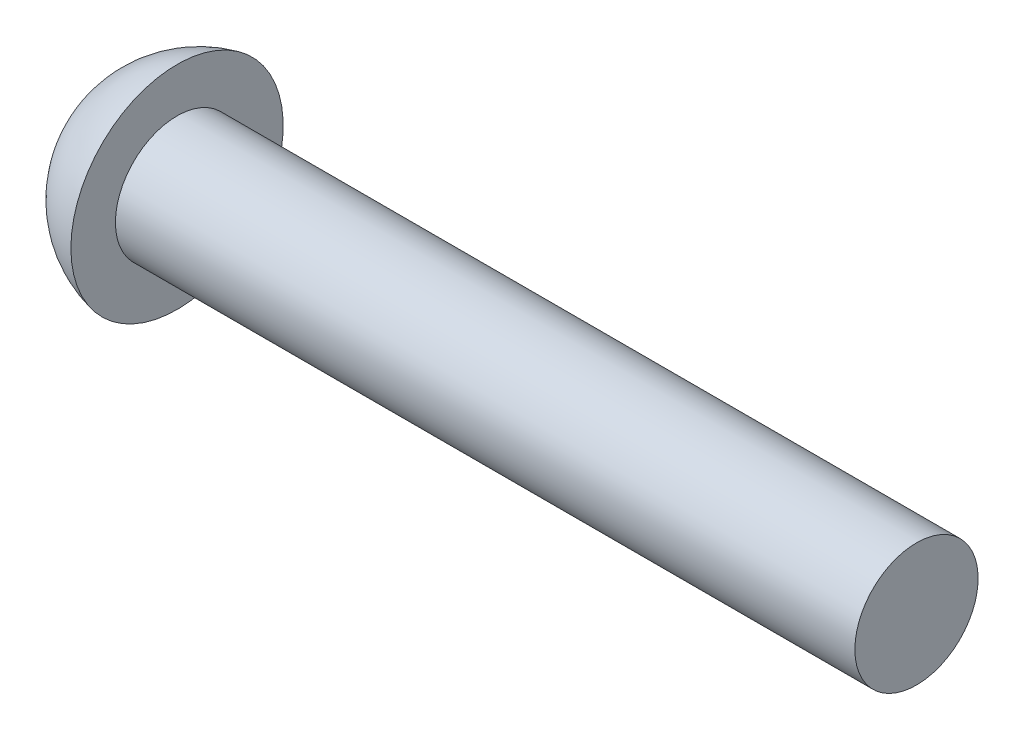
ISO-10303-21;
HEADER;
FILE_DESCRIPTION(('STEP AP214'),'2;1');
FILE_NAME('part.step','',(''),(''),'','','');
FILE_SCHEMA(('AUTOMOTIVE_DESIGN { 1 0 10303 214 1 1 1 1 }'));
ENDSEC;
DATA;
#1=APPLICATION_CONTEXT('core data for automotive mechanical design processes');
#2=APPLICATION_PROTOCOL_DEFINITION('international standard','automotive_design',2000,#1);
#3=PRODUCT_CONTEXT('',#1,'mechanical');
#4=PRODUCT('Part','Part','',(#3));
#5=PRODUCT_RELATED_PRODUCT_CATEGORY('part','',(#4));
#6=PRODUCT_DEFINITION_FORMATION('','',#4);
#7=PRODUCT_DEFINITION_CONTEXT('part definition',#1,'design');
#8=PRODUCT_DEFINITION('design','',#6,#7);
#9=PRODUCT_DEFINITION_SHAPE('','',#8);
#10=(LENGTH_UNIT() NAMED_UNIT(*) SI_UNIT(.MILLI.,.METRE.));
#11=(NAMED_UNIT(*) PLANE_ANGLE_UNIT() SI_UNIT($,.RADIAN.));
#12=(NAMED_UNIT(*) SI_UNIT($,.STERADIAN.) SOLID_ANGLE_UNIT());
#13=UNCERTAINTY_MEASURE_WITH_UNIT(LENGTH_MEASURE(1.E-05),#10,'distance_accuracy_value','');
#14=(GEOMETRIC_REPRESENTATION_CONTEXT(3) GLOBAL_UNCERTAINTY_ASSIGNED_CONTEXT((#13)) GLOBAL_UNIT_ASSIGNED_CONTEXT((#10,
#11,#12)) REPRESENTATION_CONTEXT('',''));
#15=CARTESIAN_POINT('',(0.,0.,0.));
#16=DIRECTION('',(0.,0.,1.));
#17=DIRECTION('',(1.,0.,0.));
#18=AXIS2_PLACEMENT_3D('',#15,#16,#17);
#19=CARTESIAN_POINT('',(4.4,0.,0.));
#20=DIRECTION('',(-1.,0.,0.));
#21=DIRECTION('',(0.,1.,0.));
#22=AXIS2_PLACEMENT_3D('',#19,#20,#21);
#23=SPHERICAL_SURFACE('',#22,4.4);
#24=CARTESIAN_POINT('',(3.5,0.,0.));
#25=DIRECTION('',(-1.,0.,0.));
#26=DIRECTION('',(0.,0.,1.));
#27=AXIS2_PLACEMENT_3D('',#24,#25,#26);
#28=CIRCLE('',#27,4.30697109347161);
#29=CARTESIAN_POINT('',(3.5,0.,4.30697109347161));
#30=VERTEX_POINT('',#29);
#31=EDGE_CURVE('E198',#30,#30,#28,.T.);
#32=ORIENTED_EDGE('',*,*,#31,.T.);
#33=EDGE_LOOP('',(#32));
#34=FACE_BOUND('',#33,.T.);
#35=CARTESIAN_POINT('',(0.12421590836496,0.,0.));
#36=DIRECTION('',(1.,0.,0.));
#37=DIRECTION('',(0.,0.,-1.));
#38=AXIS2_PLACEMENT_3D('',#35,#36,#37);
#39=CIRCLE('',#38,1.03810905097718);
#40=CARTESIAN_POINT('',(0.124215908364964,-0.349999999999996,-0.977328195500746));
#41=VERTEX_POINT('',#40);
#42=CARTESIAN_POINT('',(0.12421590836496,-0.977328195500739,-0.35));
#43=VERTEX_POINT('',#42);
#44=EDGE_CURVE('E320',#41,#43,#39,.F.);
#45=ORIENTED_EDGE('',*,*,#44,.F.);
#46=CARTESIAN_POINT('',(4.4,-0.35,0.));
#47=DIRECTION('',(0.,1.,0.));
#48=DIRECTION('',(0.,0.,1.));
#49=AXIS2_PLACEMENT_3D('',#46,#47,#48);
#50=CIRCLE('',#49,4.38605745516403);
#51=CARTESIAN_POINT('',(0.650493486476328,-0.349999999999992,-2.27567592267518));
#52=VERTEX_POINT('',#51);
#53=EDGE_CURVE('E247',#52,#41,#50,.T.);
#54=ORIENTED_EDGE('',*,*,#53,.F.);
#55=CARTESIAN_POINT('',(4.5622192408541,0.,-0.325361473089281));
#56=DIRECTION('',(0.446197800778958,0.,-0.894934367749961));
#57=DIRECTION('',(-0.89493436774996,0.,-0.446197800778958));
#58=AXIS2_PLACEMENT_3D('',#55,#56,#57);
#59=CIRCLE('',#58,4.38495437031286);
#60=CARTESIAN_POINT('',(0.650493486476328,0.350000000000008,-2.27567592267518));
#61=VERTEX_POINT('',#60);
#62=EDGE_CURVE('E221',#52,#61,#59,.T.);
#63=ORIENTED_EDGE('',*,*,#62,.T.);
#64=CARTESIAN_POINT('',(4.4,0.35,0.));
#65=DIRECTION('',(0.,-1.,0.));
#66=DIRECTION('',(0.,0.,-1.));
#67=AXIS2_PLACEMENT_3D('',#64,#65,#66);
#68=CIRCLE('',#67,4.38605745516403);
#69=CARTESIAN_POINT('',(0.124215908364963,0.350000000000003,-0.977328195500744));
#70=VERTEX_POINT('',#69);
#71=EDGE_CURVE('E276',#70,#61,#68,.T.);
#72=ORIENTED_EDGE('',*,*,#71,.F.);
#73=CARTESIAN_POINT('',(0.12421590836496,0.977328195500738,-0.35));
#74=VERTEX_POINT('',#73);
#75=EDGE_CURVE('E336',#74,#70,#39,.F.);
#76=ORIENTED_EDGE('',*,*,#75,.F.);
#77=CARTESIAN_POINT('',(4.4,0.,-0.35));
#78=DIRECTION('',(0.,0.,1.));
#79=DIRECTION('',(1.,0.,0.));
#80=AXIS2_PLACEMENT_3D('',#77,#78,#79);
#81=CIRCLE('',#80,4.38605745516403);
#82=CARTESIAN_POINT('',(0.650493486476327,2.27567592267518,-0.35));
#83=VERTEX_POINT('',#82);
#84=EDGE_CURVE('E215',#83,#74,#81,.T.);
#85=ORIENTED_EDGE('',*,*,#84,.F.);
#86=CARTESIAN_POINT('',(4.5622192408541,0.325361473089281,0.));
#87=DIRECTION('',(0.446197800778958,0.894934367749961,0.));
#88=DIRECTION('',(-0.89493436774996,0.446197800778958,0.));
#89=AXIS2_PLACEMENT_3D('',#86,#87,#88);
#90=CIRCLE('',#89,4.38495437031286);
#91=CARTESIAN_POINT('',(0.650493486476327,2.27567592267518,0.35));
#92=VERTEX_POINT('',#91);
#93=EDGE_CURVE('E218',#83,#92,#90,.T.);
#94=ORIENTED_EDGE('',*,*,#93,.T.);
#95=CARTESIAN_POINT('',(4.4,0.,0.35));
#96=DIRECTION('',(0.,0.,-1.));
#97=DIRECTION('',(0.,1.,0.));
#98=AXIS2_PLACEMENT_3D('',#95,#96,#97);
#99=CIRCLE('',#98,4.38605745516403);
#100=CARTESIAN_POINT('',(0.12421590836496,0.977328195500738,0.35));
#101=VERTEX_POINT('',#100);
#102=EDGE_CURVE('E206',#101,#92,#99,.T.);
#103=ORIENTED_EDGE('',*,*,#102,.F.);
#104=CARTESIAN_POINT('',(0.124215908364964,0.349999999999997,0.977328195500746));
#105=VERTEX_POINT('',#104);
#106=EDGE_CURVE('E335',#105,#101,#39,.F.);
#107=ORIENTED_EDGE('',*,*,#106,.F.);
#108=CARTESIAN_POINT('',(0.650493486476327,0.349999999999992,2.27567592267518));
#109=VERTEX_POINT('',#108);
#110=EDGE_CURVE('E231',#109,#105,#68,.T.);
#111=ORIENTED_EDGE('',*,*,#110,.F.);
#112=CARTESIAN_POINT('',(4.5622192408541,0.,0.325361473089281));
#113=DIRECTION('',(0.446197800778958,0.,0.894934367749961));
#114=DIRECTION('',(0.89493436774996,0.,-0.446197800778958));
#115=AXIS2_PLACEMENT_3D('',#112,#113,#114);
#116=CIRCLE('',#115,4.38495437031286);
#117=CARTESIAN_POINT('',(0.650493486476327,-0.350000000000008,2.27567592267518));
#118=VERTEX_POINT('',#117);
#119=EDGE_CURVE('E50',#109,#118,#116,.T.);
#120=ORIENTED_EDGE('',*,*,#119,.T.);
#121=CARTESIAN_POINT('',(0.124215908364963,-0.350000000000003,0.977328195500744));
#122=VERTEX_POINT('',#121);
#123=EDGE_CURVE('E228',#122,#118,#50,.T.);
#124=ORIENTED_EDGE('',*,*,#123,.F.);
#125=CARTESIAN_POINT('',(0.12421590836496,-0.977328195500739,0.35));
#126=VERTEX_POINT('',#125);
#127=EDGE_CURVE('E366',#126,#122,#39,.F.);
#128=ORIENTED_EDGE('',*,*,#127,.F.);
#129=CARTESIAN_POINT('',(0.650493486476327,-2.27567592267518,0.35));
#130=VERTEX_POINT('',#129);
#131=EDGE_CURVE('E212',#130,#126,#99,.T.);
#132=ORIENTED_EDGE('',*,*,#131,.F.);
#133=CARTESIAN_POINT('',(4.5622192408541,-0.325361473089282,0.));
#134=DIRECTION('',(0.446197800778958,-0.894934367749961,0.));
#135=DIRECTION('',(0.89493436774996,0.446197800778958,0.));
#136=AXIS2_PLACEMENT_3D('',#133,#134,#135);
#137=CIRCLE('',#136,4.38495437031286);
#138=CARTESIAN_POINT('',(0.650493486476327,-2.27567592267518,-0.35));
#139=VERTEX_POINT('',#138);
#140=EDGE_CURVE('E203',#130,#139,#137,.T.);
#141=ORIENTED_EDGE('',*,*,#140,.T.);
#142=EDGE_CURVE('E65',#43,#139,#81,.T.);
#143=ORIENTED_EDGE('',*,*,#142,.F.);
#144=EDGE_LOOP('',(#45,#54,#63,#72,#76,#85,#94,#103,#107,#111,#120,#124,#128,#132,#141,#143));
#145=FACE_BOUND('',#144,.T.);
#146=ADVANCED_FACE('F37',(#34,#145),#23,.T.);
#147=CARTESIAN_POINT('',(2.8,1.20397154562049,-0.35));
#148=DIRECTION('',(0.,0.,1.));
#149=DIRECTION('',(1.,0.,0.));
#150=AXIS2_PLACEMENT_3D('',#147,#148,#149);
#151=PLANE('',#150);
#152=ORIENTED_EDGE('',*,*,#84,.T.);
#153=CARTESIAN_POINT('',(-1.50567181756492,1.09763049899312,-0.35));
#154=CARTESIAN_POINT('',(-1.18894413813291,1.07438236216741,-0.35));
#155=CARTESIAN_POINT('',(-0.872221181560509,1.05106961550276,-0.35));
#156=CARTESIAN_POINT('',(-0.238786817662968,1.00427809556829,-0.35));
#157=CARTESIAN_POINT('',(0.0779245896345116,0.980799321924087,-0.35));
#158=CARTESIAN_POINT('',(0.711332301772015,0.933639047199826,-0.35));
#159=CARTESIAN_POINT('',(1.02802860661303,0.909957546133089,-0.35));
#160=CARTESIAN_POINT('',(1.66140140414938,0.862338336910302,-0.35));
#161=CARTESIAN_POINT('',(1.97807789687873,0.838400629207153,-0.35));
#162=CARTESIAN_POINT('',(2.74427771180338,0.780084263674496,-0.35));
#163=CARTESIAN_POINT('',(3.19378838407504,0.745539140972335,-0.35));
#164=CARTESIAN_POINT('',(4.09273207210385,0.675470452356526,-0.35));
#165=CARTESIAN_POINT('',(4.54216508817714,0.639946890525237,-0.35));
#166=CARTESIAN_POINT('',(5.21622299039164,0.585458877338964,-0.35));
#167=CARTESIAN_POINT('',(5.44089636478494,0.567095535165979,-0.35));
#168=CARTESIAN_POINT('',(5.89019733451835,0.529824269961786,-0.35));
#169=CARTESIAN_POINT('',(6.1148249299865,0.510916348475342,-0.35));
#170=CARTESIAN_POINT('',(6.56402183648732,0.472366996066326,-0.35));
#171=CARTESIAN_POINT('',(6.78859114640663,0.452725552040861,-0.35));
#172=CARTESIAN_POINT('',(7.23762949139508,0.412307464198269,-0.35));
#173=CARTESIAN_POINT('',(7.46209852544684,0.391530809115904,-0.35));
#174=CARTESIAN_POINT('',(7.68649620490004,0.369985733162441,-0.35));
#175=B_SPLINE_CURVE_WITH_KNOTS('',3,(#153,#154,#155,#156,#157,#158,#159,#160,#161,#162,#163,
#164,#165,#166,#167,#168,#169,#170,#171,#172,#173,#174),.UNSPECIFIED.,.F.,.F.,(4,2,2,2,2,2,2,2,
2,2,4),(0.,0.952739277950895,1.90548070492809,2.85822206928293,3.81096174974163,
5.16346955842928,6.51597172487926,7.19223892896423,7.86850421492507,8.54478158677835,
9.22106567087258),.UNSPECIFIED.);
#176=CARTESIAN_POINT('',(2.8,0.775693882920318,-0.349999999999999));
#177=VERTEX_POINT('',#176);
#178=EDGE_CURVE('E355',#74,#177,#175,.T.);
#179=ORIENTED_EDGE('',*,*,#178,.T.);
#180=DIRECTION('',(0.,1.,0.));
#181=VECTOR('',#180,1.);
#182=CARTESIAN_POINT('',(2.8,-1.20397154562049,-0.35));
#183=LINE('',#182,#181);
#184=CARTESIAN_POINT('',(2.8,1.20397154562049,-0.35));
#185=VERTEX_POINT('',#184);
#186=EDGE_CURVE('E299',#177,#185,#183,.T.);
#187=ORIENTED_EDGE('',*,*,#186,.T.);
#188=DIRECTION('',(0.89493436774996,-0.446197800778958,0.));
#189=VECTOR('',#188,1.);
#190=CARTESIAN_POINT('',(0.,2.6,-0.35));
#191=LINE('',#190,#189);
#192=EDGE_CURVE('E277',#83,#185,#191,.T.);
#193=ORIENTED_EDGE('',*,*,#192,.F.);
#194=EDGE_LOOP('',(#152,#179,#187,#193));
#195=FACE_BOUND('',#194,.T.);
#196=ADVANCED_FACE('F171',(#195),#151,.T.);
#197=CARTESIAN_POINT('',(2.8,-1.20397154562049,-0.35));
#198=VERTEX_POINT('',#197);
#199=CARTESIAN_POINT('',(2.8,-0.775693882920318,-0.349999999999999));
#200=VERTEX_POINT('',#199);
#201=EDGE_CURVE('E297',#198,#200,#183,.T.);
#202=ORIENTED_EDGE('',*,*,#201,.T.);
#203=CARTESIAN_POINT('',(-1.50567181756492,-1.09763049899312,-0.35));
#204=CARTESIAN_POINT('',(-1.18894413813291,-1.07438236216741,-0.35));
#205=CARTESIAN_POINT('',(-0.872221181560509,-1.05106961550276,-0.35));
#206=CARTESIAN_POINT('',(-0.238786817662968,-1.00427809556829,-0.35));
#207=CARTESIAN_POINT('',(0.0779245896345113,-0.980799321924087,-0.35));
#208=CARTESIAN_POINT('',(0.711332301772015,-0.933639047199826,-0.35));
#209=CARTESIAN_POINT('',(1.02802860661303,-0.909957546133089,-0.35));
#210=CARTESIAN_POINT('',(1.66140140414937,-0.862338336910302,-0.35));
#211=CARTESIAN_POINT('',(1.97807789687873,-0.838400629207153,-0.35));
#212=CARTESIAN_POINT('',(2.74427771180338,-0.780084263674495,-0.35));
#213=CARTESIAN_POINT('',(3.19378838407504,-0.745539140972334,-0.35));
#214=CARTESIAN_POINT('',(4.09273207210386,-0.675470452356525,-0.35));
#215=CARTESIAN_POINT('',(4.54216508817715,-0.639946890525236,-0.35));
#216=CARTESIAN_POINT('',(5.21622299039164,-0.585458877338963,-0.35));
#217=CARTESIAN_POINT('',(5.44089636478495,-0.567095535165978,-0.35));
#218=CARTESIAN_POINT('',(5.89019733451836,-0.529824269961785,-0.35));
#219=CARTESIAN_POINT('',(6.1148249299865,-0.510916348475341,-0.35));
#220=CARTESIAN_POINT('',(6.56402183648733,-0.472366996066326,-0.35));
#221=CARTESIAN_POINT('',(6.78859114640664,-0.452725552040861,-0.35));
#222=CARTESIAN_POINT('',(7.23762949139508,-0.412307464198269,-0.35));
#223=CARTESIAN_POINT('',(7.46209852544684,-0.391530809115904,-0.35));
#224=CARTESIAN_POINT('',(7.68649620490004,-0.36998573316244,-0.35));
#225=B_SPLINE_CURVE_WITH_KNOTS('',3,(#203,#204,#205,#206,#207,#208,#209,#210,#211,#212,#213,
#214,#215,#216,#217,#218,#219,#220,#221,#222,#223,#224),.UNSPECIFIED.,.F.,.F.,(4,2,2,2,2,2,2,2,
2,2,4),(0.,0.952739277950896,1.90548070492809,2.85822206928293,3.81096174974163,
5.16346955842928,6.51597172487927,7.19223892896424,7.86850421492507,8.54478158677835,
9.22106567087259),.UNSPECIFIED.);
#226=EDGE_CURVE('E334',#200,#43,#225,.F.);
#227=ORIENTED_EDGE('',*,*,#226,.T.);
#228=ORIENTED_EDGE('',*,*,#142,.T.);
#229=DIRECTION('',(0.89493436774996,0.446197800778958,0.));
#230=VECTOR('',#229,1.);
#231=CARTESIAN_POINT('',(0.,-2.6,-0.35));
#232=LINE('',#231,#230);
#233=EDGE_CURVE('E282',#139,#198,#232,.T.);
#234=ORIENTED_EDGE('',*,*,#233,.T.);
#235=EDGE_LOOP('',(#202,#227,#228,#234));
#236=FACE_BOUND('',#235,.T.);
#237=ADVANCED_FACE('F177',(#236),#151,.T.);
#238=CARTESIAN_POINT('',(2.8,-1.20397154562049,0.35));
#239=DIRECTION('',(0.,0.,-1.));
#240=DIRECTION('',(0.,1.,0.));
#241=AXIS2_PLACEMENT_3D('',#238,#239,#240);
#242=PLANE('',#241);
#243=DIRECTION('',(0.,-1.,0.));
#244=VECTOR('',#243,1.);
#245=CARTESIAN_POINT('',(2.8,1.20397154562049,0.35));
#246=LINE('',#245,#244);
#247=CARTESIAN_POINT('',(2.8,1.20397154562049,0.35));
#248=VERTEX_POINT('',#247);
#249=CARTESIAN_POINT('',(2.8,0.775693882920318,0.349999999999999));
#250=VERTEX_POINT('',#249);
#251=EDGE_CURVE('E290',#248,#250,#246,.T.);
#252=ORIENTED_EDGE('',*,*,#251,.T.);
#253=CARTESIAN_POINT('',(-1.50567181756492,1.09763049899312,0.35));
#254=CARTESIAN_POINT('',(-1.18894413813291,1.07438236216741,0.35));
#255=CARTESIAN_POINT('',(-0.872221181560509,1.05106961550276,0.35));
#256=CARTESIAN_POINT('',(-0.238786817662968,1.00427809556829,0.35));
#257=CARTESIAN_POINT('',(0.0779245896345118,0.980799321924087,0.35));
#258=CARTESIAN_POINT('',(0.711332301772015,0.933639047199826,0.35));
#259=CARTESIAN_POINT('',(1.02802860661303,0.909957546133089,0.35));
#260=CARTESIAN_POINT('',(1.66140140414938,0.862338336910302,0.35));
#261=CARTESIAN_POINT('',(1.97807789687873,0.838400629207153,0.35));
#262=CARTESIAN_POINT('',(2.74427771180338,0.780084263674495,0.35));
#263=CARTESIAN_POINT('',(3.19378838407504,0.745539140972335,0.35));
#264=CARTESIAN_POINT('',(4.09273207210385,0.675470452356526,0.35));
#265=CARTESIAN_POINT('',(4.54216508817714,0.639946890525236,0.35));
#266=CARTESIAN_POINT('',(5.21622299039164,0.585458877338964,0.35));
#267=CARTESIAN_POINT('',(5.44089636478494,0.567095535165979,0.35));
#268=CARTESIAN_POINT('',(5.89019733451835,0.529824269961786,0.35));
#269=CARTESIAN_POINT('',(6.1148249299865,0.510916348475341,0.35));
#270=CARTESIAN_POINT('',(6.56402183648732,0.472366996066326,0.35));
#271=CARTESIAN_POINT('',(6.78859114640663,0.452725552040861,0.35));
#272=CARTESIAN_POINT('',(7.23762949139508,0.412307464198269,0.35));
#273=CARTESIAN_POINT('',(7.46209852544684,0.391530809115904,0.35));
#274=CARTESIAN_POINT('',(7.68649620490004,0.36998573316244,0.35));
#275=B_SPLINE_CURVE_WITH_KNOTS('',3,(#253,#254,#255,#256,#257,#258,#259,#260,#261,#262,#263,
#264,#265,#266,#267,#268,#269,#270,#271,#272,#273,#274),.UNSPECIFIED.,.F.,.F.,(4,2,2,2,2,2,2,2,
2,2,4),(0.,0.952739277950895,1.90548070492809,2.85822206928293,3.81096174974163,
5.16346955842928,6.51597172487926,7.19223892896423,7.86850421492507,8.54478158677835,
9.22106567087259),.UNSPECIFIED.);
#276=EDGE_CURVE('E252',#250,#101,#275,.F.);
#277=ORIENTED_EDGE('',*,*,#276,.T.);
#278=ORIENTED_EDGE('',*,*,#102,.T.);
#279=DIRECTION('',(0.89493436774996,-0.446197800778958,0.));
#280=VECTOR('',#279,1.);
#281=CARTESIAN_POINT('',(0.,2.6,0.35));
#282=LINE('',#281,#280);
#283=EDGE_CURVE('E280',#92,#248,#282,.T.);
#284=ORIENTED_EDGE('',*,*,#283,.T.);
#285=EDGE_LOOP('',(#252,#277,#278,#284));
#286=FACE_BOUND('',#285,.T.);
#287=ADVANCED_FACE('F351',(#286),#242,.T.);
#288=ORIENTED_EDGE('',*,*,#131,.T.);
#289=CARTESIAN_POINT('',(-1.50567181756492,-1.09763049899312,0.35));
#290=CARTESIAN_POINT('',(-1.18894413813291,-1.07438236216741,0.35));
#291=CARTESIAN_POINT('',(-0.872221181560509,-1.05106961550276,0.35));
#292=CARTESIAN_POINT('',(-0.238786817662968,-1.00427809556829,0.35));
#293=CARTESIAN_POINT('',(0.0779245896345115,-0.980799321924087,0.35));
#294=CARTESIAN_POINT('',(0.711332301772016,-0.933639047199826,0.35));
#295=CARTESIAN_POINT('',(1.02802860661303,-0.909957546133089,0.35));
#296=CARTESIAN_POINT('',(1.66140140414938,-0.862338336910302,0.35));
#297=CARTESIAN_POINT('',(1.97807789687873,-0.838400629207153,0.35));
#298=CARTESIAN_POINT('',(2.74427771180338,-0.780084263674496,0.35));
#299=CARTESIAN_POINT('',(3.19378838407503,-0.745539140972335,0.35));
#300=CARTESIAN_POINT('',(4.09273207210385,-0.675470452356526,0.35));
#301=CARTESIAN_POINT('',(4.54216508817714,-0.639946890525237,0.35));
#302=CARTESIAN_POINT('',(5.21622299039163,-0.585458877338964,0.35));
#303=CARTESIAN_POINT('',(5.44089636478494,-0.567095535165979,0.35));
#304=CARTESIAN_POINT('',(5.89019733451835,-0.529824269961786,0.35));
#305=CARTESIAN_POINT('',(6.11482492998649,-0.510916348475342,0.35));
#306=CARTESIAN_POINT('',(6.56402183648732,-0.472366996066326,0.35));
#307=CARTESIAN_POINT('',(6.78859114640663,-0.452725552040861,0.35));
#308=CARTESIAN_POINT('',(7.23762949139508,-0.412307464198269,0.35));
#309=CARTESIAN_POINT('',(7.46209852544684,-0.391530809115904,0.35));
#310=CARTESIAN_POINT('',(7.68649620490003,-0.36998573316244,0.35));
#311=B_SPLINE_CURVE_WITH_KNOTS('',3,(#289,#290,#291,#292,#293,#294,#295,#296,#297,#298,#299,
#300,#301,#302,#303,#304,#305,#306,#307,#308,#309,#310),.UNSPECIFIED.,.F.,.F.,(4,2,2,2,2,2,2,2,
2,2,4),(0.,0.952739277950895,1.90548070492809,2.85822206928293,3.81096174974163,
5.16346955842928,6.51597172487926,7.19223892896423,7.86850421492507,8.54478158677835,
9.22106567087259),.UNSPECIFIED.);
#312=CARTESIAN_POINT('',(2.8,-0.775693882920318,0.349999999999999));
#313=VERTEX_POINT('',#312);
#314=EDGE_CURVE('E367',#126,#313,#311,.T.);
#315=ORIENTED_EDGE('',*,*,#314,.T.);
#316=CARTESIAN_POINT('',(2.8,-1.20397154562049,0.35));
#317=VERTEX_POINT('',#316);
#318=EDGE_CURVE('E293',#313,#317,#246,.T.);
#319=ORIENTED_EDGE('',*,*,#318,.T.);
#320=DIRECTION('',(0.89493436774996,0.446197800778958,0.));
#321=VECTOR('',#320,1.);
#322=CARTESIAN_POINT('',(0.,-2.6,0.349999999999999));
#323=LINE('',#322,#321);
#324=EDGE_CURVE('E284',#130,#317,#323,.T.);
#325=ORIENTED_EDGE('',*,*,#324,.F.);
#326=EDGE_LOOP('',(#288,#315,#319,#325));
#327=FACE_BOUND('',#326,.T.);
#328=ADVANCED_FACE('F395',(#327),#242,.T.);
#329=CARTESIAN_POINT('',(2.8,1.20397154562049,-0.35));
#330=DIRECTION('',(-1.,0.,0.));
#331=DIRECTION('',(0.,0.,1.));
#332=AXIS2_PLACEMENT_3D('',#329,#330,#331);
#333=PLANE('',#332);
#334=ORIENTED_EDGE('',*,*,#318,.F.);
#335=CARTESIAN_POINT('',(2.8,0.,0.));
#336=DIRECTION('',(-1.,0.,0.));
#337=DIRECTION('',(0.,0.,1.));
#338=AXIS2_PLACEMENT_3D('',#335,#336,#337);
#339=CIRCLE('',#338,0.851);
#340=EDGE_CURVE('E329',#200,#313,#339,.T.);
#341=ORIENTED_EDGE('',*,*,#340,.F.);
#342=ORIENTED_EDGE('',*,*,#201,.F.);
#343=DIRECTION('',(0.,0.,1.));
#344=VECTOR('',#343,1.);
#345=CARTESIAN_POINT('',(2.8,-1.20397154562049,-0.35));
#346=LINE('',#345,#344);
#347=EDGE_CURVE('E287',#198,#317,#346,.T.);
#348=ORIENTED_EDGE('',*,*,#347,.T.);
#349=EDGE_LOOP('',(#334,#341,#342,#348));
#350=FACE_BOUND('',#349,.T.);
#351=ADVANCED_FACE('F393',(#350),#333,.T.);
#352=DIRECTION('',(0.,0.,-1.));
#353=VECTOR('',#352,1.);
#354=CARTESIAN_POINT('',(2.8,-0.350000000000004,1.20397154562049));
#355=LINE('',#354,#353);
#356=CARTESIAN_POINT('',(2.8,-0.349999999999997,-0.775693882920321));
#357=VERTEX_POINT('',#356);
#358=CARTESIAN_POINT('',(2.8,-0.349999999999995,-1.20397154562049));
#359=VERTEX_POINT('',#358);
#360=EDGE_CURVE('E269',#357,#359,#355,.T.);
#361=ORIENTED_EDGE('',*,*,#360,.F.);
#362=CARTESIAN_POINT('',(2.8,0.350000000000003,-0.775693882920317));
#363=VERTEX_POINT('',#362);
#364=EDGE_CURVE('E57',#363,#357,#339,.T.);
#365=ORIENTED_EDGE('',*,*,#364,.F.);
#366=DIRECTION('',(0.,0.,1.));
#367=VECTOR('',#366,1.);
#368=CARTESIAN_POINT('',(2.8,0.350000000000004,-1.20397154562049));
#369=LINE('',#368,#367);
#370=CARTESIAN_POINT('',(2.8,0.350000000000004,-1.20397154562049));
#371=VERTEX_POINT('',#370);
#372=EDGE_CURVE('E272',#371,#363,#369,.T.);
#373=ORIENTED_EDGE('',*,*,#372,.F.);
#374=DIRECTION('',(0.,-1.,0.));
#375=VECTOR('',#374,1.);
#376=CARTESIAN_POINT('',(2.8,0.350000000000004,-1.20397154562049));
#377=LINE('',#376,#375);
#378=EDGE_CURVE('E263',#371,#359,#377,.T.);
#379=ORIENTED_EDGE('',*,*,#378,.T.);
#380=EDGE_LOOP('',(#361,#365,#373,#379));
#381=FACE_BOUND('',#380,.T.);
#382=ADVANCED_FACE('F324',(#381),#333,.T.);
#383=ORIENTED_EDGE('',*,*,#186,.F.);
#384=EDGE_CURVE('E328',#250,#177,#339,.T.);
#385=ORIENTED_EDGE('',*,*,#384,.F.);
#386=ORIENTED_EDGE('',*,*,#251,.F.);
#387=DIRECTION('',(0.,0.,-1.));
#388=VECTOR('',#387,1.);
#389=CARTESIAN_POINT('',(2.8,1.20397154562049,0.35));
#390=LINE('',#389,#388);
#391=EDGE_CURVE('E294',#248,#185,#390,.T.);
#392=ORIENTED_EDGE('',*,*,#391,.T.);
#393=EDGE_LOOP('',(#383,#385,#386,#392));
#394=FACE_BOUND('',#393,.T.);
#395=ADVANCED_FACE('F402',(#394),#333,.T.);
#396=CARTESIAN_POINT('',(2.8,0.349999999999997,0.775693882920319));
#397=VERTEX_POINT('',#396);
#398=CARTESIAN_POINT('',(2.8,0.349999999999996,1.20397154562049));
#399=VERTEX_POINT('',#398);
#400=EDGE_CURVE('E245',#397,#399,#369,.T.);
#401=ORIENTED_EDGE('',*,*,#400,.F.);
#402=CARTESIAN_POINT('',(2.8,-0.350000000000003,0.775693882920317));
#403=VERTEX_POINT('',#402);
#404=EDGE_CURVE('E332',#403,#397,#339,.T.);
#405=ORIENTED_EDGE('',*,*,#404,.F.);
#406=CARTESIAN_POINT('',(2.8,-0.350000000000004,1.20397154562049));
#407=VERTEX_POINT('',#406);
#408=EDGE_CURVE('E266',#407,#403,#355,.T.);
#409=ORIENTED_EDGE('',*,*,#408,.F.);
#410=DIRECTION('',(0.,1.,0.));
#411=VECTOR('',#410,1.);
#412=CARTESIAN_POINT('',(2.8,-0.350000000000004,1.20397154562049));
#413=LINE('',#412,#411);
#414=EDGE_CURVE('E270',#407,#399,#413,.T.);
#415=ORIENTED_EDGE('',*,*,#414,.T.);
#416=EDGE_LOOP('',(#401,#405,#409,#415));
#417=FACE_BOUND('',#416,.T.);
#418=ADVANCED_FACE('F397',(#417),#333,.T.);
#419=CARTESIAN_POINT('',(2.8,0.349999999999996,1.20397154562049));
#420=DIRECTION('',(0.,-1.,0.));
#421=DIRECTION('',(1.,0.,0.));
#422=AXIS2_PLACEMENT_3D('',#419,#420,#421);
#423=PLANE('',#422);
#424=ORIENTED_EDGE('',*,*,#110,.T.);
#425=CARTESIAN_POINT('',(-1.50567181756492,0.349999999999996,1.09763049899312));
#426=CARTESIAN_POINT('',(-1.18894413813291,0.349999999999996,1.07438236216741));
#427=CARTESIAN_POINT('',(-0.872221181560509,0.349999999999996,1.05106961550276));
#428=CARTESIAN_POINT('',(-0.238786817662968,0.349999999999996,1.00427809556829));
#429=CARTESIAN_POINT('',(0.0779245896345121,0.349999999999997,0.980799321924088));
#430=CARTESIAN_POINT('',(0.711332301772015,0.349999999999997,0.933639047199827));
#431=CARTESIAN_POINT('',(1.02802860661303,0.349999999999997,0.90995754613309));
#432=CARTESIAN_POINT('',(1.66140140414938,0.349999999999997,0.862338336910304));
#433=CARTESIAN_POINT('',(1.97807789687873,0.349999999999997,0.838400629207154));
#434=CARTESIAN_POINT('',(2.74427771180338,0.349999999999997,0.780084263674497));
#435=CARTESIAN_POINT('',(3.19378838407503,0.349999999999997,0.745539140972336));
#436=CARTESIAN_POINT('',(4.09273207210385,0.349999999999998,0.675470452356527));
#437=CARTESIAN_POINT('',(4.54216508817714,0.349999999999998,0.639946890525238));
#438=CARTESIAN_POINT('',(5.21622299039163,0.349999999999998,0.585458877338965));
#439=CARTESIAN_POINT('',(5.44089636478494,0.349999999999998,0.567095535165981));
#440=CARTESIAN_POINT('',(5.89019733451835,0.349999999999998,0.529824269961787));
#441=CARTESIAN_POINT('',(6.11482492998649,0.349999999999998,0.510916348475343));
#442=CARTESIAN_POINT('',(6.56402183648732,0.349999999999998,0.472366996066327));
#443=CARTESIAN_POINT('',(6.78859114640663,0.349999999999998,0.452725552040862));
#444=CARTESIAN_POINT('',(7.23762949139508,0.349999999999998,0.412307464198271));
#445=CARTESIAN_POINT('',(7.46209852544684,0.349999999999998,0.391530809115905));
#446=CARTESIAN_POINT('',(7.68649620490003,0.349999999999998,0.369985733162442));
#447=B_SPLINE_CURVE_WITH_KNOTS('',3,(#425,#426,#427,#428,#429,#430,#431,#432,#433,#434,#435,
#436,#437,#438,#439,#440,#441,#442,#443,#444,#445,#446),.UNSPECIFIED.,.F.,.F.,(4,2,2,2,2,2,2,2,
2,2,4),(0.,0.952739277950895,1.90548070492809,2.85822206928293,3.81096174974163,
5.16346955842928,6.51597172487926,7.19223892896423,7.86850421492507,8.54478158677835,
9.22106567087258),.UNSPECIFIED.);
#448=EDGE_CURVE('E417',#105,#397,#447,.T.);
#449=ORIENTED_EDGE('',*,*,#448,.T.);
#450=ORIENTED_EDGE('',*,*,#400,.T.);
#451=DIRECTION('',(0.89493436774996,0.,-0.446197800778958));
#452=VECTOR('',#451,1.);
#453=CARTESIAN_POINT('',(0.,0.349999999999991,2.6));
#454=LINE('',#453,#452);
#455=EDGE_CURVE('E238',#109,#399,#454,.T.);
#456=ORIENTED_EDGE('',*,*,#455,.F.);
#457=EDGE_LOOP('',(#424,#449,#450,#456));
#458=FACE_BOUND('',#457,.T.);
#459=ADVANCED_FACE('F242',(#458),#423,.T.);
#460=CARTESIAN_POINT('',(2.8,-0.349999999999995,-1.20397154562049));
#461=DIRECTION('',(0.,1.,0.));
#462=DIRECTION('',(0.,0.,1.));
#463=AXIS2_PLACEMENT_3D('',#460,#461,#462);
#464=PLANE('',#463);
#465=ORIENTED_EDGE('',*,*,#408,.T.);
#466=CARTESIAN_POINT('',(-1.50567181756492,-0.350000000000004,1.09763049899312));
#467=CARTESIAN_POINT('',(-1.18894413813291,-0.350000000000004,1.07438236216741));
#468=CARTESIAN_POINT('',(-0.872221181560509,-0.350000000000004,1.05106961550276));
#469=CARTESIAN_POINT('',(-0.238786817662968,-0.350000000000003,1.00427809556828));
#470=CARTESIAN_POINT('',(0.0779245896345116,-0.350000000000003,0.980799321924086));
#471=CARTESIAN_POINT('',(0.711332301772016,-0.350000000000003,0.933639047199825));
#472=CARTESIAN_POINT('',(1.02802860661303,-0.350000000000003,0.909957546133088));
#473=CARTESIAN_POINT('',(1.66140140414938,-0.350000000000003,0.862338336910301));
#474=CARTESIAN_POINT('',(1.97807789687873,-0.350000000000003,0.838400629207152));
#475=CARTESIAN_POINT('',(2.74427771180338,-0.350000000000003,0.780084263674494));
#476=CARTESIAN_POINT('',(3.19378838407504,-0.350000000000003,0.745539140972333));
#477=CARTESIAN_POINT('',(4.09273207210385,-0.350000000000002,0.675470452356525));
#478=CARTESIAN_POINT('',(4.54216508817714,-0.350000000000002,0.639946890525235));
#479=CARTESIAN_POINT('',(5.21622299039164,-0.350000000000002,0.585458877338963));
#480=CARTESIAN_POINT('',(5.44089636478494,-0.350000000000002,0.567095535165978));
#481=CARTESIAN_POINT('',(5.89019733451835,-0.350000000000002,0.529824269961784));
#482=CARTESIAN_POINT('',(6.1148249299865,-0.350000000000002,0.51091634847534));
#483=CARTESIAN_POINT('',(6.56402183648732,-0.350000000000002,0.472366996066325));
#484=CARTESIAN_POINT('',(6.78859114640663,-0.350000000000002,0.45272555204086));
#485=CARTESIAN_POINT('',(7.23762949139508,-0.350000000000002,0.412307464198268));
#486=CARTESIAN_POINT('',(7.46209852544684,-0.350000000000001,0.391530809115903));
#487=CARTESIAN_POINT('',(7.68649620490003,-0.350000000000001,0.369985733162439));
#488=B_SPLINE_CURVE_WITH_KNOTS('',3,(#466,#467,#468,#469,#470,#471,#472,#473,#474,#475,#476,
#477,#478,#479,#480,#481,#482,#483,#484,#485,#486,#487),.UNSPECIFIED.,.F.,.F.,(4,2,2,2,2,2,2,2,
2,2,4),(0.,0.952739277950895,1.90548070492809,2.85822206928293,3.81096174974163,
5.16346955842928,6.51597172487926,7.19223892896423,7.86850421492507,8.54478158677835,
9.22106567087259),.UNSPECIFIED.);
#489=EDGE_CURVE('E360',#403,#122,#488,.F.);
#490=ORIENTED_EDGE('',*,*,#489,.T.);
#491=ORIENTED_EDGE('',*,*,#123,.T.);
#492=DIRECTION('',(0.89493436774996,0.,-0.446197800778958));
#493=VECTOR('',#492,1.);
#494=CARTESIAN_POINT('',(0.,-0.350000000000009,2.6));
#495=LINE('',#494,#493);
#496=EDGE_CURVE('E240',#118,#407,#495,.T.);
#497=ORIENTED_EDGE('',*,*,#496,.T.);
#498=EDGE_LOOP('',(#465,#490,#491,#497));
#499=FACE_BOUND('',#498,.T.);
#500=ADVANCED_FACE('F371',(#499),#464,.T.);
#501=ORIENTED_EDGE('',*,*,#372,.T.);
#502=CARTESIAN_POINT('',(-1.50567181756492,0.350000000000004,-1.09763049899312));
#503=CARTESIAN_POINT('',(-1.18894413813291,0.350000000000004,-1.07438236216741));
#504=CARTESIAN_POINT('',(-0.872221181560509,0.350000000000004,-1.05106961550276));
#505=CARTESIAN_POINT('',(-0.238786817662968,0.350000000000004,-1.00427809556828));
#506=CARTESIAN_POINT('',(0.0779245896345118,0.350000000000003,-0.980799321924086));
#507=CARTESIAN_POINT('',(0.711332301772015,0.350000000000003,-0.933639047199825));
#508=CARTESIAN_POINT('',(1.02802860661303,0.350000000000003,-0.909957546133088));
#509=CARTESIAN_POINT('',(1.66140140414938,0.350000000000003,-0.862338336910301));
#510=CARTESIAN_POINT('',(1.97807789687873,0.350000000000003,-0.838400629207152));
#511=CARTESIAN_POINT('',(2.74427771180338,0.350000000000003,-0.780084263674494));
#512=CARTESIAN_POINT('',(3.19378838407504,0.350000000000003,-0.745539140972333));
#513=CARTESIAN_POINT('',(4.09273207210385,0.350000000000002,-0.675470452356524));
#514=CARTESIAN_POINT('',(4.54216508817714,0.350000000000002,-0.639946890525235));
#515=CARTESIAN_POINT('',(5.21622299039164,0.350000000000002,-0.585458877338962));
#516=CARTESIAN_POINT('',(5.44089636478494,0.350000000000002,-0.567095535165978));
#517=CARTESIAN_POINT('',(5.89019733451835,0.350000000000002,-0.529824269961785));
#518=CARTESIAN_POINT('',(6.1148249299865,0.350000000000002,-0.51091634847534));
#519=CARTESIAN_POINT('',(6.56402183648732,0.350000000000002,-0.472366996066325));
#520=CARTESIAN_POINT('',(6.78859114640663,0.350000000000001,-0.45272555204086));
#521=CARTESIAN_POINT('',(7.23762949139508,0.350000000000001,-0.412307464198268));
#522=CARTESIAN_POINT('',(7.46209852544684,0.350000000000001,-0.391530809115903));
#523=CARTESIAN_POINT('',(7.68649620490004,0.350000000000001,-0.369985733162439));
#524=B_SPLINE_CURVE_WITH_KNOTS('',3,(#502,#503,#504,#505,#506,#507,#508,#509,#510,#511,#512,
#513,#514,#515,#516,#517,#518,#519,#520,#521,#522,#523),.UNSPECIFIED.,.F.,.F.,(4,2,2,2,2,2,2,2,
2,2,4),(0.,0.952739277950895,1.90548070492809,2.85822206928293,3.81096174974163,
5.16346955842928,6.51597172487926,7.19223892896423,7.86850421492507,8.54478158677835,
9.22106567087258),.UNSPECIFIED.);
#525=EDGE_CURVE('E312',#363,#70,#524,.F.);
#526=ORIENTED_EDGE('',*,*,#525,.T.);
#527=ORIENTED_EDGE('',*,*,#71,.T.);
#528=DIRECTION('',(0.89493436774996,0.,0.446197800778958));
#529=VECTOR('',#528,1.);
#530=CARTESIAN_POINT('',(0.,0.350000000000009,-2.6));
#531=LINE('',#530,#529);
#532=EDGE_CURVE('E249',#61,#371,#531,.T.);
#533=ORIENTED_EDGE('',*,*,#532,.T.);
#534=EDGE_LOOP('',(#501,#526,#527,#533));
#535=FACE_BOUND('',#534,.T.);
#536=ADVANCED_FACE('F310',(#535),#423,.T.);
#537=ORIENTED_EDGE('',*,*,#53,.T.);
#538=CARTESIAN_POINT('',(-1.50567181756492,-0.349999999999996,-1.09763049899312));
#539=CARTESIAN_POINT('',(-1.18894413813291,-0.349999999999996,-1.07438236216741));
#540=CARTESIAN_POINT('',(-0.87222118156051,-0.349999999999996,-1.05106961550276));
#541=CARTESIAN_POINT('',(-0.238786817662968,-0.349999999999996,-1.00427809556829));
#542=CARTESIAN_POINT('',(0.0779245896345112,-0.349999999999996,-0.980799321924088));
#543=CARTESIAN_POINT('',(0.711332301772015,-0.349999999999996,-0.933639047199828));
#544=CARTESIAN_POINT('',(1.02802860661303,-0.349999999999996,-0.90995754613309));
#545=CARTESIAN_POINT('',(1.66140140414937,-0.349999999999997,-0.862338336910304));
#546=CARTESIAN_POINT('',(1.97807789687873,-0.349999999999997,-0.838400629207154));
#547=CARTESIAN_POINT('',(2.74427771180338,-0.349999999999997,-0.780084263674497));
#548=CARTESIAN_POINT('',(3.19378838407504,-0.349999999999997,-0.745539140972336));
#549=CARTESIAN_POINT('',(4.09273207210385,-0.349999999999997,-0.675470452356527));
#550=CARTESIAN_POINT('',(4.54216508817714,-0.349999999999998,-0.639946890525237));
#551=CARTESIAN_POINT('',(5.21622299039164,-0.349999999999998,-0.585458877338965));
#552=CARTESIAN_POINT('',(5.44089636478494,-0.349999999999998,-0.56709553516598));
#553=CARTESIAN_POINT('',(5.89019733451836,-0.349999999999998,-0.529824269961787));
#554=CARTESIAN_POINT('',(6.1148249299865,-0.349999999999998,-0.510916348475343));
#555=CARTESIAN_POINT('',(6.56402183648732,-0.349999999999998,-0.472366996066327));
#556=CARTESIAN_POINT('',(6.78859114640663,-0.349999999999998,-0.452725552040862));
#557=CARTESIAN_POINT('',(7.23762949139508,-0.349999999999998,-0.41230746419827));
#558=CARTESIAN_POINT('',(7.46209852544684,-0.349999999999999,-0.391530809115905));
#559=CARTESIAN_POINT('',(7.68649620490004,-0.349999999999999,-0.369985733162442));
#560=B_SPLINE_CURVE_WITH_KNOTS('',3,(#538,#539,#540,#541,#542,#543,#544,#545,#546,#547,#548,
#549,#550,#551,#552,#553,#554,#555,#556,#557,#558,#559),.UNSPECIFIED.,.F.,.F.,(4,2,2,2,2,2,2,2,
2,2,4),(0.,0.952739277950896,1.90548070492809,2.85822206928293,3.81096174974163,
5.16346955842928,6.51597172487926,7.19223892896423,7.86850421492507,8.54478158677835,
9.22106567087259),.UNSPECIFIED.);
#561=EDGE_CURVE('E11',#41,#357,#560,.T.);
#562=ORIENTED_EDGE('',*,*,#561,.T.);
#563=ORIENTED_EDGE('',*,*,#360,.T.);
#564=DIRECTION('',(0.89493436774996,0.,0.446197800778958));
#565=VECTOR('',#564,1.);
#566=CARTESIAN_POINT('',(0.,-0.34999999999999,-2.6));
#567=LINE('',#566,#565);
#568=EDGE_CURVE('E260',#52,#359,#567,.T.);
#569=ORIENTED_EDGE('',*,*,#568,.F.);
#570=EDGE_LOOP('',(#537,#562,#563,#569));
#571=FACE_BOUND('',#570,.T.);
#572=ADVANCED_FACE('F194',(#571),#464,.T.);
#573=CARTESIAN_POINT('',(-25.4,0.,0.));
#574=DIRECTION('',(-1.,0.,0.));
#575=DIRECTION('',(0.,0.,1.));
#576=AXIS2_PLACEMENT_3D('',#573,#574,#575);
#577=CYLINDRICAL_SURFACE('',#576,2.5);
#578=CARTESIAN_POINT('',(33.5,0.,0.));
#579=DIRECTION('',(-1.,0.,0.));
#580=DIRECTION('',(0.,0.,1.));
#581=AXIS2_PLACEMENT_3D('',#578,#579,#580);
#582=CIRCLE('',#581,2.5);
#583=CARTESIAN_POINT('',(33.5,0.,2.5));
#584=VERTEX_POINT('',#583);
#585=EDGE_CURVE('E208',#584,#584,#582,.T.);
#586=ORIENTED_EDGE('',*,*,#585,.T.);
#587=EDGE_LOOP('',(#586));
#588=FACE_BOUND('',#587,.T.);
#589=CARTESIAN_POINT('',(3.5,0.,0.));
#590=DIRECTION('',(-1.,0.,0.));
#591=DIRECTION('',(0.,0.,1.));
#592=AXIS2_PLACEMENT_3D('',#589,#590,#591);
#593=CIRCLE('',#592,2.5);
#594=CARTESIAN_POINT('',(3.5,0.,2.5));
#595=VERTEX_POINT('',#594);
#596=EDGE_CURVE('E201',#595,#595,#593,.T.);
#597=ORIENTED_EDGE('',*,*,#596,.F.);
#598=EDGE_LOOP('',(#597));
#599=FACE_BOUND('',#598,.T.);
#600=ADVANCED_FACE('F39',(#588,#599),#577,.T.);
#601=CARTESIAN_POINT('',(3.5,2.5,0.));
#602=DIRECTION('',(-1.,0.,0.));
#603=DIRECTION('',(0.,0.,1.));
#604=AXIS2_PLACEMENT_3D('',#601,#602,#603);
#605=PLANE('',#604);
#606=ORIENTED_EDGE('',*,*,#31,.F.);
#607=EDGE_LOOP('',(#606));
#608=FACE_BOUND('',#607,.T.);
#609=ORIENTED_EDGE('',*,*,#596,.T.);
#610=EDGE_LOOP('',(#609));
#611=FACE_BOUND('',#610,.T.);
#612=ADVANCED_FACE('F185',(#608,#611),#605,.F.);
#613=CARTESIAN_POINT('',(33.5,2.5,0.));
#614=DIRECTION('',(1.,0.,0.));
#615=DIRECTION('',(0.,0.,-1.));
#616=AXIS2_PLACEMENT_3D('',#613,#614,#615);
#617=PLANE('',#616);
#618=ORIENTED_EDGE('',*,*,#585,.F.);
#619=EDGE_LOOP('',(#618));
#620=FACE_BOUND('',#619,.T.);
#621=ADVANCED_FACE('F183',(#620),#617,.T.);
#622=CARTESIAN_POINT('',(2.8,1.20397154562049,0.35));
#623=DIRECTION('',(0.446197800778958,0.894934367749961,0.));
#624=DIRECTION('',(-0.89493436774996,0.446197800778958,0.));
#625=AXIS2_PLACEMENT_3D('',#622,#623,#624);
#626=PLANE('',#625);
#627=ORIENTED_EDGE('',*,*,#192,.T.);
#628=ORIENTED_EDGE('',*,*,#391,.F.);
#629=ORIENTED_EDGE('',*,*,#283,.F.);
#630=ORIENTED_EDGE('',*,*,#93,.F.);
#631=EDGE_LOOP('',(#627,#628,#629,#630));
#632=FACE_BOUND('',#631,.T.);
#633=ADVANCED_FACE('F192',(#632),#626,.F.);
#634=CARTESIAN_POINT('',(2.8,-1.20397154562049,-0.35));
#635=DIRECTION('',(0.446197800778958,-0.894934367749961,0.));
#636=DIRECTION('',(0.89493436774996,0.446197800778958,0.));
#637=AXIS2_PLACEMENT_3D('',#634,#635,#636);
#638=PLANE('',#637);
#639=ORIENTED_EDGE('',*,*,#324,.T.);
#640=ORIENTED_EDGE('',*,*,#347,.F.);
#641=ORIENTED_EDGE('',*,*,#233,.F.);
#642=ORIENTED_EDGE('',*,*,#140,.F.);
#643=EDGE_LOOP('',(#639,#640,#641,#642));
#644=FACE_BOUND('',#643,.T.);
#645=ADVANCED_FACE('F384',(#644),#638,.F.);
#646=CARTESIAN_POINT('',(2.8,-0.350000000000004,1.20397154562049));
#647=DIRECTION('',(0.446197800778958,0.,0.894934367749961));
#648=DIRECTION('',(-0.89493436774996,0.,0.446197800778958));
#649=AXIS2_PLACEMENT_3D('',#646,#647,#648);
#650=PLANE('',#649);
#651=ORIENTED_EDGE('',*,*,#455,.T.);
#652=ORIENTED_EDGE('',*,*,#414,.F.);
#653=ORIENTED_EDGE('',*,*,#496,.F.);
#654=ORIENTED_EDGE('',*,*,#119,.F.);
#655=EDGE_LOOP('',(#651,#652,#653,#654));
#656=FACE_BOUND('',#655,.T.);
#657=ADVANCED_FACE('F236',(#656),#650,.F.);
#658=CARTESIAN_POINT('',(2.8,0.350000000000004,-1.20397154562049));
#659=DIRECTION('',(0.446197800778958,0.,-0.894934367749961));
#660=DIRECTION('',(0.89493436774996,0.,0.446197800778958));
#661=AXIS2_PLACEMENT_3D('',#658,#659,#660);
#662=PLANE('',#661);
#663=ORIENTED_EDGE('',*,*,#568,.T.);
#664=ORIENTED_EDGE('',*,*,#378,.F.);
#665=ORIENTED_EDGE('',*,*,#532,.F.);
#666=ORIENTED_EDGE('',*,*,#62,.F.);
#667=EDGE_LOOP('',(#663,#664,#665,#666));
#668=FACE_BOUND('',#667,.T.);
#669=ADVANCED_FACE('F315',(#668),#662,.F.);
#670=CARTESIAN_POINT('',(2.8,0.,0.));
#671=DIRECTION('',(-1.,0.,0.));
#672=DIRECTION('',(0.,0.,1.));
#673=AXIS2_PLACEMENT_3D('',#670,#671,#672);
#674=CONICAL_SURFACE('',#673,0.851,0.0698131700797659);
#675=EDGE_CURVE('E330',#397,#250,#339,.T.);
#676=ORIENTED_EDGE('',*,*,#675,.F.);
#677=ORIENTED_EDGE('',*,*,#448,.F.);
#678=ORIENTED_EDGE('',*,*,#106,.T.);
#679=ORIENTED_EDGE('',*,*,#276,.F.);
#680=EDGE_LOOP('',(#676,#677,#678,#679));
#681=FACE_BOUND('',#680,.T.);
#682=ADVANCED_FACE('F168',(#681),#674,.F.);
#683=ORIENTED_EDGE('',*,*,#127,.T.);
#684=ORIENTED_EDGE('',*,*,#489,.F.);
#685=EDGE_CURVE('E596',#313,#403,#339,.T.);
#686=ORIENTED_EDGE('',*,*,#685,.F.);
#687=ORIENTED_EDGE('',*,*,#314,.F.);
#688=EDGE_LOOP('',(#683,#684,#686,#687));
#689=FACE_BOUND('',#688,.T.);
#690=ADVANCED_FACE('F382',(#689),#674,.F.);
#691=ORIENTED_EDGE('',*,*,#75,.T.);
#692=ORIENTED_EDGE('',*,*,#525,.F.);
#693=EDGE_CURVE('E325',#177,#363,#339,.T.);
#694=ORIENTED_EDGE('',*,*,#693,.F.);
#695=ORIENTED_EDGE('',*,*,#178,.F.);
#696=EDGE_LOOP('',(#691,#692,#694,#695));
#697=FACE_BOUND('',#696,.T.);
#698=ADVANCED_FACE('F166',(#697),#674,.F.);
#699=EDGE_CURVE('E326',#357,#200,#339,.T.);
#700=ORIENTED_EDGE('',*,*,#699,.F.);
#701=ORIENTED_EDGE('',*,*,#561,.F.);
#702=ORIENTED_EDGE('',*,*,#44,.T.);
#703=ORIENTED_EDGE('',*,*,#226,.F.);
#704=EDGE_LOOP('',(#700,#701,#702,#703));
#705=FACE_BOUND('',#704,.T.);
#706=ADVANCED_FACE('F161',(#705),#674,.F.);
#707=CARTESIAN_POINT('',(3.0765066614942,0.,0.));
#708=DIRECTION('',(-1.,0.,0.));
#709=DIRECTION('',(0.,0.,1.));
#710=AXIS2_PLACEMENT_3D('',#707,#708,#709);
#711=CONICAL_SURFACE('',#710,0.,1.25663706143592);
#712=ORIENTED_EDGE('',*,*,#675,.T.);
#713=ORIENTED_EDGE('',*,*,#384,.T.);
#714=ORIENTED_EDGE('',*,*,#693,.T.);
#715=ORIENTED_EDGE('',*,*,#364,.T.);
#716=ORIENTED_EDGE('',*,*,#699,.T.);
#717=ORIENTED_EDGE('',*,*,#340,.T.);
#718=ORIENTED_EDGE('',*,*,#685,.T.);
#719=ORIENTED_EDGE('',*,*,#404,.T.);
#720=EDGE_LOOP('',(#712,#713,#714,#715,#716,#717,#718,#719));
#721=FACE_BOUND('',#720,.T.);
#722=CARTESIAN_POINT('',(3.0765066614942,0.,0.));
#723=VERTEX_POINT('',#722);
#724=VERTEX_LOOP('',#723);
#725=FACE_BOUND('',#724,.T.);
#726=ADVANCED_FACE('F159',(#721,#725),#711,.F.);
#727=CLOSED_SHELL('',(#146,#196,#237,#287,#328,#351,#382,#395,#418,#459,#500,#536,#572,#600,
#612,#621,#633,#645,#657,#669,#682,#690,#698,#706,#726));
#728=MANIFOLD_SOLID_BREP('B2',#727);
#729=ADVANCED_BREP_SHAPE_REPRESENTATION('',(#18,#728),#14);
#730=SHAPE_DEFINITION_REPRESENTATION(#9,#729);
ENDSEC;
END-ISO-10303-21;
